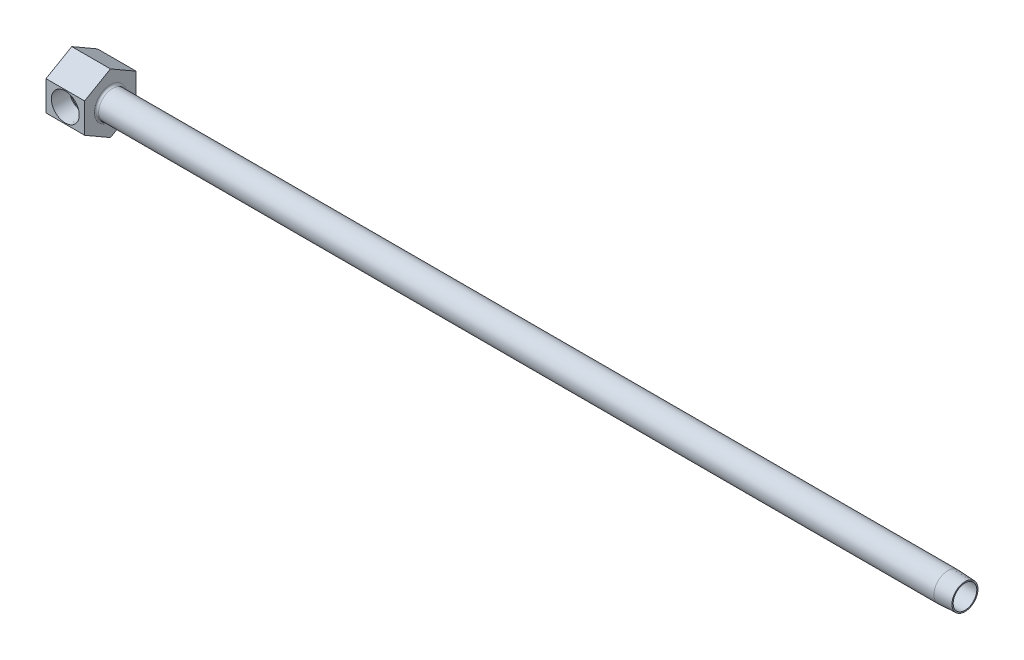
ISO-10303-21;
HEADER;
FILE_DESCRIPTION(('STEP AP214'),'2;1');
FILE_NAME('part.step','',(''),(''),'','','');
FILE_SCHEMA(('AUTOMOTIVE_DESIGN { 1 0 10303 214 1 1 1 1 }'));
ENDSEC;
DATA;
#1=APPLICATION_CONTEXT('core data for automotive mechanical design processes');
#2=APPLICATION_PROTOCOL_DEFINITION('international standard','automotive_design',2000,#1);
#3=PRODUCT_CONTEXT('',#1,'mechanical');
#4=PRODUCT('Part','Part','',(#3));
#5=PRODUCT_RELATED_PRODUCT_CATEGORY('part','',(#4));
#6=PRODUCT_DEFINITION_FORMATION('','',#4);
#7=PRODUCT_DEFINITION_CONTEXT('part definition',#1,'design');
#8=PRODUCT_DEFINITION('design','',#6,#7);
#9=PRODUCT_DEFINITION_SHAPE('','',#8);
#10=(LENGTH_UNIT() NAMED_UNIT(*) SI_UNIT(.MILLI.,.METRE.));
#11=(NAMED_UNIT(*) PLANE_ANGLE_UNIT() SI_UNIT($,.RADIAN.));
#12=(NAMED_UNIT(*) SI_UNIT($,.STERADIAN.) SOLID_ANGLE_UNIT());
#13=UNCERTAINTY_MEASURE_WITH_UNIT(LENGTH_MEASURE(1.E-05),#10,'distance_accuracy_value','');
#14=(GEOMETRIC_REPRESENTATION_CONTEXT(3) GLOBAL_UNCERTAINTY_ASSIGNED_CONTEXT((#13)) GLOBAL_UNIT_ASSIGNED_CONTEXT((#10,
#11,#12)) REPRESENTATION_CONTEXT('',''));
#15=CARTESIAN_POINT('',(0.,0.,0.));
#16=DIRECTION('',(0.,0.,1.));
#17=DIRECTION('',(1.,0.,0.));
#18=AXIS2_PLACEMENT_3D('',#15,#16,#17);
#19=CARTESIAN_POINT('',(7.14375,0.,19.05));
#20=DIRECTION('',(0.,0.,1.));
#21=DIRECTION('',(1.,0.,0.));
#22=AXIS2_PLACEMENT_3D('',#19,#20,#21);
#23=CONICAL_SURFACE('',#22,5.1435,0.0523598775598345);
#24=CARTESIAN_POINT('',(7.14375,0.,19.05));
#25=DIRECTION('',(0.,0.,-1.));
#26=DIRECTION('',(-1.,0.,0.));
#27=AXIS2_PLACEMENT_3D('',#24,#25,#26);
#28=CIRCLE('',#27,5.1435);
#29=CARTESIAN_POINT('',(2.00025,0.,19.05));
#30=VERTEX_POINT('',#29);
#31=EDGE_CURVE('E512',#30,#30,#28,.T.);
#32=ORIENTED_EDGE('',*,*,#31,.F.);
#33=EDGE_LOOP('',(#32));
#34=FACE_BOUND('',#33,.T.);
#35=CARTESIAN_POINT('',(7.14375,0.,12.7000000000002));
#36=DIRECTION('',(0.,0.,-1.));
#37=DIRECTION('',(-1.,0.,0.));
#38=AXIS2_PLACEMENT_3D('',#35,#36,#37);
#39=CIRCLE('',#38,4.81071060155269);
#40=CARTESIAN_POINT('',(10.9073758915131,-2.99634054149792,12.7000000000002));
#41=VERTEX_POINT('',#40);
#42=CARTESIAN_POINT('',(10.9073758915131,2.99634054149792,12.7000000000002));
#43=VERTEX_POINT('',#42);
#44=EDGE_CURVE('E528',#41,#43,#39,.T.);
#45=ORIENTED_EDGE('',*,*,#44,.T.);
#46=CARTESIAN_POINT('',(10.9071937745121,2.99655245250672,12.6998000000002));
#47=CARTESIAN_POINT('',(10.971635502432,2.92155827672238,12.7705639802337));
#48=CARTESIAN_POINT('',(11.0345784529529,2.84341410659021,12.8393139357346));
#49=CARTESIAN_POINT('',(11.1569073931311,2.68056902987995,12.9723675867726));
#50=CARTESIAN_POINT('',(11.2162880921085,2.59585877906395,13.0366646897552));
#51=CARTESIAN_POINT('',(11.3887731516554,2.33059710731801,13.2228141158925));
#52=CARTESIAN_POINT('',(11.4952955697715,2.13996459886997,13.3369144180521));
#53=CARTESIAN_POINT('',(11.6670238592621,1.76978922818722,13.520146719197));
#54=CARTESIAN_POINT('',(11.7362081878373,1.59429861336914,13.5936668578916));
#55=CARTESIAN_POINT('',(11.8243838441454,1.32069459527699,13.6871793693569));
#56=CARTESIAN_POINT('',(11.8511557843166,1.22786736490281,13.7155347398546));
#57=CARTESIAN_POINT('',(11.8990876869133,1.0391950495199,13.7662595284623));
#58=CARTESIAN_POINT('',(11.9202500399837,0.943351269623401,13.7886314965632));
#59=CARTESIAN_POINT('',(11.9566990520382,0.748466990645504,13.8271421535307));
#60=CARTESIAN_POINT('',(11.971935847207,0.649406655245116,13.8432279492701));
#61=CARTESIAN_POINT('',(11.9959472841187,0.449682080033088,13.8685692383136));
#62=CARTESIAN_POINT('',(12.0047249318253,0.349018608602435,13.8778279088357));
#63=CARTESIAN_POINT('',(12.0156291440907,0.146869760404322,13.8893288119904));
#64=CARTESIAN_POINT('',(12.0177517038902,0.0453839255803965,13.8915668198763));
#65=CARTESIAN_POINT('',(12.0152840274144,-0.157407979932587,13.8889645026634));
#66=CARTESIAN_POINT('',(12.0106943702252,-0.258714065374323,13.8841247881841));
#67=CARTESIAN_POINT('',(11.9957865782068,-0.449057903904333,13.8683984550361));
#68=CARTESIAN_POINT('',(11.9861593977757,-0.538211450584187,13.8582411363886));
#69=CARTESIAN_POINT('',(11.961864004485,-0.715062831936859,13.8325939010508));
#70=CARTESIAN_POINT('',(11.9471941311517,-0.802760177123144,13.8171022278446));
#71=CARTESIAN_POINT('',(11.8959888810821,-1.06271154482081,13.762990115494));
#72=CARTESIAN_POINT('',(11.8522396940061,-1.23204639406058,13.7167134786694));
#73=CARTESIAN_POINT('',(11.7458224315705,-1.56656708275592,13.6038703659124));
#74=CARTESIAN_POINT('',(11.6823922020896,-1.73122409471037,13.5364852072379));
#75=CARTESIAN_POINT('',(11.5406571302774,-2.04618319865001,13.3853583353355));
#76=CARTESIAN_POINT('',(11.4623317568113,-2.19646504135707,13.3015940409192));
#77=CARTESIAN_POINT('',(11.3067680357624,-2.45998630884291,13.1343941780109));
#78=CARTESIAN_POINT('',(11.2311482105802,-2.57539375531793,13.0528153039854));
#79=CARTESIAN_POINT('',(11.0735639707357,-2.79452635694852,12.8818550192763));
#80=CARTESIAN_POINT('',(10.9916301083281,-2.89830245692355,12.792510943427));
#81=CARTESIAN_POINT('',(10.9071937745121,-2.99655245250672,12.6998000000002));
#82=B_SPLINE_CURVE_WITH_KNOTS('',3,(#46,#47,#48,#49,#50,#51,#52,#53,#54,#55,#56,#57,#58,#59,#60,
#61,#62,#63,#64,#65,#66,#67,#68,#69,#70,#71,#72,#73,#74,#75,#76,#77,#78,#79,#80,#81),
.UNSPECIFIED.,.F.,.F.,(4,2,2,2,2,2,2,2,2,2,2,2,2,2,2,2,2,4),(0.,0.364634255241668,
0.72979730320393,1.46525067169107,2.06997219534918,2.37170467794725,2.67330836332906,
2.97739780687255,3.28134564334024,3.58547634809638,3.88958081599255,4.15999530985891,
4.43049893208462,4.97084503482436,5.53548493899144,6.10090884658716,6.58103480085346,
7.05896806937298),.UNSPECIFIED.);
#83=EDGE_CURVE('E123',#43,#41,#82,.T.);
#84=ORIENTED_EDGE('',*,*,#83,.T.);
#85=EDGE_LOOP('',(#45,#84));
#86=FACE_BOUND('',#85,.T.);
#87=ADVANCED_FACE('F15',(#34,#86),#23,.F.);
#88=CARTESIAN_POINT('',(11.9544606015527,0.,12.7000000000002));
#89=DIRECTION('',(0.,0.,1.));
#90=DIRECTION('',(1.,0.,0.));
#91=AXIS2_PLACEMENT_3D('',#88,#89,#90);
#92=PLANE('',#91);
#93=ORIENTED_EDGE('',*,*,#44,.F.);
#94=DIRECTION('',(1.,0.,0.));
#95=VECTOR('',#94,1.);
#96=CARTESIAN_POINT('',(66.1375087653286,-2.99634054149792,12.7000000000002));
#97=LINE('',#96,#95);
#98=CARTESIAN_POINT('',(10.3187500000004,-2.99634054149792,12.7000000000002));
#99=VERTEX_POINT('',#98);
#100=EDGE_CURVE('E120',#41,#99,#97,.F.);
#101=ORIENTED_EDGE('',*,*,#100,.T.);
#102=CARTESIAN_POINT('',(7.14375,0.,12.7000000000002));
#103=DIRECTION('',(0.,0.,-1.));
#104=DIRECTION('',(-1.,0.,0.));
#105=AXIS2_PLACEMENT_3D('',#102,#103,#104);
#106=CIRCLE('',#105,4.36562500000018);
#107=CARTESIAN_POINT('',(10.3187500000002,2.99634054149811,12.7000000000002));
#108=VERTEX_POINT('',#107);
#109=EDGE_CURVE('E119',#99,#108,#106,.T.);
#110=ORIENTED_EDGE('',*,*,#109,.T.);
#111=DIRECTION('',(1.,0.,0.));
#112=VECTOR('',#111,1.);
#113=CARTESIAN_POINT('',(66.1375087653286,2.99634054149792,12.7000000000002));
#114=LINE('',#113,#112);
#115=EDGE_CURVE('E126',#108,#43,#114,.T.);
#116=ORIENTED_EDGE('',*,*,#115,.T.);
#117=EDGE_LOOP('',(#93,#101,#110,#116));
#118=FACE_BOUND('',#117,.T.);
#119=ADVANCED_FACE('F156',(#118),#92,.T.);
#120=CARTESIAN_POINT('',(7.14375,0.,35.9059426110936));
#121=DIRECTION('',(0.,0.,-1.));
#122=DIRECTION('',(-1.,0.,0.));
#123=AXIS2_PLACEMENT_3D('',#120,#121,#122);
#124=CYLINDRICAL_SURFACE('',#123,4.36562500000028);
#125=ORIENTED_EDGE('',*,*,#109,.F.);
#126=CARTESIAN_POINT('',(7.14375,0.,9.525));
#127=DIRECTION('',(0.707106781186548,0.,-0.707106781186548));
#128=DIRECTION('',(-0.707106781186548,0.,-0.707106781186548));
#129=AXIS2_PLACEMENT_3D('',#126,#127,#128);
#130=ELLIPSE('',#129,6.17392608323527,4.36562500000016);
#131=CARTESIAN_POINT('',(7.14375,-4.3656250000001,9.525));
#132=VERTEX_POINT('',#131);
#133=EDGE_CURVE('E105',#99,#132,#130,.T.);
#134=ORIENTED_EDGE('',*,*,#133,.T.);
#135=CARTESIAN_POINT('',(7.14375,0.,9.525));
#136=DIRECTION('',(-0.707106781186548,0.,-0.707106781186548));
#137=DIRECTION('',(0.707106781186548,0.,-0.707106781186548));
#138=AXIS2_PLACEMENT_3D('',#135,#136,#137);
#139=ELLIPSE('',#138,6.17392608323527,4.36562500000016);
#140=CARTESIAN_POINT('',(8.98888023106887,-3.95653586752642,7.67986976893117));
#141=VERTEX_POINT('',#140);
#142=EDGE_CURVE('E100',#132,#141,#139,.F.);
#143=ORIENTED_EDGE('',*,*,#142,.T.);
#144=CARTESIAN_POINT('',(7.14375,0.,7.67986976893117));
#145=DIRECTION('',(0.,0.,-1.));
#146=DIRECTION('',(-1.,0.,0.));
#147=AXIS2_PLACEMENT_3D('',#144,#145,#146);
#148=CIRCLE('',#147,4.36562500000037);
#149=CARTESIAN_POINT('',(8.98888023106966,3.95653586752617,7.67986976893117));
#150=VERTEX_POINT('',#149);
#151=EDGE_CURVE('E113',#141,#150,#148,.T.);
#152=ORIENTED_EDGE('',*,*,#151,.T.);
#153=CARTESIAN_POINT('',(7.14375,4.3656250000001,9.525));
#154=VERTEX_POINT('',#153);
#155=EDGE_CURVE('E30',#150,#154,#139,.F.);
#156=ORIENTED_EDGE('',*,*,#155,.T.);
#157=EDGE_CURVE('E122',#154,#108,#130,.T.);
#158=ORIENTED_EDGE('',*,*,#157,.T.);
#159=EDGE_LOOP('',(#125,#134,#143,#152,#156,#158));
#160=FACE_BOUND('',#159,.T.);
#161=ADVANCED_FACE('F116',(#160),#124,.F.);
#162=CARTESIAN_POINT('',(7.14375,0.,7.67986976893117));
#163=DIRECTION('',(0.,0.,1.));
#164=DIRECTION('',(1.,0.,0.));
#165=AXIS2_PLACEMENT_3D('',#162,#163,#164);
#166=CONICAL_SURFACE('',#165,4.36562500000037,1.0471975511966);
#167=ORIENTED_EDGE('',*,*,#151,.F.);
#168=CARTESIAN_POINT('',(8.9894997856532,-3.95662913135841,7.68006976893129));
#169=CARTESIAN_POINT('',(8.91497560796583,-3.94541760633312,7.6560189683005));
#170=CARTESIAN_POINT('',(8.84020256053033,-3.93428272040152,7.6327193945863));
#171=CARTESIAN_POINT('',(8.69001846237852,-3.91242782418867,7.58793860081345));
#172=CARTESIAN_POINT('',(8.61460714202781,-3.90170800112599,7.56645819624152));
#173=CARTESIAN_POINT('',(8.38848524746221,-3.87074056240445,7.50556917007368));
#174=CARTESIAN_POINT('',(8.2367287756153,-3.8515020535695,7.46932807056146));
#175=CARTESIAN_POINT('',(8.00667896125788,-3.82676825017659,7.42384959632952));
#176=CARTESIAN_POINT('',(7.92948623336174,-3.81920348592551,7.41015805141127));
#177=CARTESIAN_POINT('',(7.77441965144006,-3.80585437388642,7.38622945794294));
#178=CARTESIAN_POINT('',(7.69654594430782,-3.80006965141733,7.37599168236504));
#179=CARTESIAN_POINT('',(7.53967894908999,-3.79060206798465,7.35933225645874));
#180=CARTESIAN_POINT('',(7.46068163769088,-3.78693482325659,7.35293894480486));
#181=CARTESIAN_POINT('',(7.30231301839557,-3.7819879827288,7.34434534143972));
#182=CARTESIAN_POINT('',(7.2229414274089,-3.78071064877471,7.34214902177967));
#183=CARTESIAN_POINT('',(7.14355,-3.78074215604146,7.34218750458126));
#184=B_SPLINE_CURVE_WITH_KNOTS('',3,(#168,#169,#170,#171,#172,#173,#174,#175,#176,#177,#178,
#179,#180,#181,#182,#183),.UNSPECIFIED.,.F.,.F.,(4,2,2,2,2,2,2,4),(0.,0.237303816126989,
0.474713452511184,0.945835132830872,1.18204117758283,1.41819746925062,1.65607385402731,
1.89417525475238),.UNSPECIFIED.);
#185=CARTESIAN_POINT('',(7.14375,-3.78074215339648,7.34218750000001));
#186=VERTEX_POINT('',#185);
#187=EDGE_CURVE('E109',#141,#186,#184,.T.);
#188=ORIENTED_EDGE('',*,*,#187,.T.);
#189=DIRECTION('',(0.,0.866025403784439,-0.5));
#190=VECTOR('',#189,1.);
#191=CARTESIAN_POINT('',(7.14375,0.,5.159375));
#192=LINE('',#191,#190);
#193=CARTESIAN_POINT('',(7.14375,0.,5.159375));
#194=VERTEX_POINT('',#193);
#195=EDGE_CURVE('E200',#186,#194,#192,.T.);
#196=ORIENTED_EDGE('',*,*,#195,.T.);
#197=DIRECTION('',(0.,0.866025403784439,0.5));
#198=VECTOR('',#197,1.);
#199=CARTESIAN_POINT('',(7.14375,0.,5.159375));
#200=LINE('',#199,#198);
#201=CARTESIAN_POINT('',(7.14375,3.78074215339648,7.34218750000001));
#202=VERTEX_POINT('',#201);
#203=EDGE_CURVE('E486',#194,#202,#200,.T.);
#204=ORIENTED_EDGE('',*,*,#203,.T.);
#205=CARTESIAN_POINT('',(7.14355,3.78074215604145,7.34218750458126));
#206=CARTESIAN_POINT('',(7.20515303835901,3.78073202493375,7.34217451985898));
#207=CARTESIAN_POINT('',(7.26674694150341,3.78149280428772,7.34348695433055));
#208=CARTESIAN_POINT('',(7.38976236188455,3.78448017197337,7.34867189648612));
#209=CARTESIAN_POINT('',(7.45118394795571,3.78670605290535,7.3525431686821));
#210=CARTESIAN_POINT('',(7.63466542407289,3.79545033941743,7.36782927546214));
#211=CARTESIAN_POINT('',(7.75632841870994,3.80403629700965,7.38291749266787));
#212=CARTESIAN_POINT('',(8.11659337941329,3.83592256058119,7.44024735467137));
#213=CARTESIAN_POINT('',(8.35266311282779,3.8653919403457,7.49460284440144));
#214=CARTESIAN_POINT('',(8.65303625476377,3.90716169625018,7.57737916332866));
#215=CARTESIAN_POINT('',(8.72054620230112,3.91683509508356,7.59689306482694));
#216=CARTESIAN_POINT('',(8.855265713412,3.93652410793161,7.63741882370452));
#217=CARTESIAN_POINT('',(8.92247399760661,3.94654056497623,7.65843453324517));
#218=CARTESIAN_POINT('',(8.9894997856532,3.9566291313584,7.68006976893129));
#219=B_SPLINE_CURVE_WITH_KNOTS('',3,(#205,#206,#207,#208,#209,#210,#211,#212,#213,#214,#215,
#216,#217,#218),.UNSPECIFIED.,.F.,.F.,(4,2,2,2,2,2,4),(0.,0.184774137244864,0.369459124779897,
0.73767480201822,1.46761028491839,1.68043381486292,1.89382432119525),.UNSPECIFIED.);
#220=EDGE_CURVE('E187',#202,#150,#219,.T.);
#221=ORIENTED_EDGE('',*,*,#220,.T.);
#222=EDGE_LOOP('',(#167,#188,#196,#204,#221));
#223=FACE_BOUND('',#222,.T.);
#224=ADVANCED_FACE('F201',(#223),#166,.F.);
#225=CARTESIAN_POINT('',(14.2875,5.4992613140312,19.05));
#226=DIRECTION('',(0.,0.,-1.));
#227=DIRECTION('',(-1.,0.,0.));
#228=AXIS2_PLACEMENT_3D('',#225,#226,#227);
#229=PLANE('',#228);
#230=DIRECTION('',(0.,-1.,0.));
#231=VECTOR('',#230,1.);
#232=CARTESIAN_POINT('',(0.,5.4992613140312,19.05));
#233=LINE('',#232,#231);
#234=CARTESIAN_POINT('',(0.,5.4992613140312,19.05));
#235=VERTEX_POINT('',#234);
#236=CARTESIAN_POINT('',(0.,-5.49926131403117,19.05));
#237=VERTEX_POINT('',#236);
#238=EDGE_CURVE('E515',#235,#237,#233,.T.);
#239=ORIENTED_EDGE('',*,*,#238,.T.);
#240=DIRECTION('',(-1.,0.,0.));
#241=VECTOR('',#240,1.);
#242=CARTESIAN_POINT('',(14.2875,-5.49926131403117,19.05));
#243=LINE('',#242,#241);
#244=CARTESIAN_POINT('',(14.2875,-5.49926131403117,19.05));
#245=VERTEX_POINT('',#244);
#246=EDGE_CURVE('E496',#245,#237,#243,.T.);
#247=ORIENTED_EDGE('',*,*,#246,.F.);
#248=DIRECTION('',(0.,-1.,0.));
#249=VECTOR('',#248,1.);
#250=CARTESIAN_POINT('',(14.2875,5.4992613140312,19.05));
#251=LINE('',#250,#249);
#252=CARTESIAN_POINT('',(14.2875,5.4992613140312,19.05));
#253=VERTEX_POINT('',#252);
#254=EDGE_CURVE('E502',#253,#245,#251,.T.);
#255=ORIENTED_EDGE('',*,*,#254,.F.);
#256=DIRECTION('',(-1.,0.,0.));
#257=VECTOR('',#256,1.);
#258=CARTESIAN_POINT('',(14.2875,5.4992613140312,19.05));
#259=LINE('',#258,#257);
#260=EDGE_CURVE('E493',#253,#235,#259,.T.);
#261=ORIENTED_EDGE('',*,*,#260,.T.);
#262=EDGE_LOOP('',(#239,#247,#255,#261));
#263=FACE_BOUND('',#262,.T.);
#264=ORIENTED_EDGE('',*,*,#31,.T.);
#265=EDGE_LOOP('',(#264));
#266=FACE_BOUND('',#265,.T.);
#267=ADVANCED_FACE('F204',(#263,#266),#229,.F.);
#268=CARTESIAN_POINT('',(14.2875,-5.49926131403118,0.));
#269=DIRECTION('',(1.,0.,0.));
#270=DIRECTION('',(0.,1.,0.));
#271=AXIS2_PLACEMENT_3D('',#268,#269,#270);
#272=PLANE('',#271);
#273=CARTESIAN_POINT('',(14.2875,0.,9.525));
#274=DIRECTION('',(1.,0.,0.));
#275=DIRECTION('',(0.,1.,0.));
#276=AXIS2_PLACEMENT_3D('',#273,#274,#275);
#277=CIRCLE('',#276,5.9309);
#278=CARTESIAN_POINT('',(14.2875,5.9309,9.525));
#279=VERTEX_POINT('',#278);
#280=EDGE_CURVE('E199',#279,#279,#277,.F.);
#281=ORIENTED_EDGE('',*,*,#280,.T.);
#282=EDGE_LOOP('',(#281));
#283=FACE_BOUND('',#282,.T.);
#284=DIRECTION('',(0.,0.5,-0.866025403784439));
#285=VECTOR('',#284,1.);
#286=CARTESIAN_POINT('',(14.2875,-10.9985226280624,9.525));
#287=LINE('',#286,#285);
#288=CARTESIAN_POINT('',(14.2875,-10.9985226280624,9.525));
#289=VERTEX_POINT('',#288);
#290=CARTESIAN_POINT('',(14.2875,-5.49926131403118,0.));
#291=VERTEX_POINT('',#290);
#292=EDGE_CURVE('E473',#289,#291,#287,.T.);
#293=ORIENTED_EDGE('',*,*,#292,.T.);
#294=DIRECTION('',(0.,1.,0.));
#295=VECTOR('',#294,1.);
#296=CARTESIAN_POINT('',(14.2875,-5.49926131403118,0.));
#297=LINE('',#296,#295);
#298=CARTESIAN_POINT('',(14.2875,5.49926131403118,0.));
#299=VERTEX_POINT('',#298);
#300=EDGE_CURVE('E475',#291,#299,#297,.T.);
#301=ORIENTED_EDGE('',*,*,#300,.T.);
#302=DIRECTION('',(0.,0.5,0.866025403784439));
#303=VECTOR('',#302,1.);
#304=CARTESIAN_POINT('',(14.2875,5.49926131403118,0.));
#305=LINE('',#304,#303);
#306=CARTESIAN_POINT('',(14.2875,10.9985226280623,9.525));
#307=VERTEX_POINT('',#306);
#308=EDGE_CURVE('E506',#299,#307,#305,.T.);
#309=ORIENTED_EDGE('',*,*,#308,.T.);
#310=DIRECTION('',(0.,-0.5,0.86602540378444));
#311=VECTOR('',#310,1.);
#312=CARTESIAN_POINT('',(14.2875,10.9985226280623,9.525));
#313=LINE('',#312,#311);
#314=EDGE_CURVE('E504',#307,#253,#313,.T.);
#315=ORIENTED_EDGE('',*,*,#314,.T.);
#316=ORIENTED_EDGE('',*,*,#254,.T.);
#317=DIRECTION('',(0.,-0.5,-0.866025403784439));
#318=VECTOR('',#317,1.);
#319=CARTESIAN_POINT('',(14.2875,-5.49926131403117,19.05));
#320=LINE('',#319,#318);
#321=EDGE_CURVE('E38',#245,#289,#320,.T.);
#322=ORIENTED_EDGE('',*,*,#321,.T.);
#323=EDGE_LOOP('',(#293,#301,#309,#315,#316,#322));
#324=FACE_BOUND('',#323,.T.);
#325=ADVANCED_FACE('F230',(#283,#324),#272,.T.);
#326=CARTESIAN_POINT('',(14.2875,-10.9985226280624,9.525));
#327=DIRECTION('',(0.,0.866025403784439,0.5));
#328=DIRECTION('',(0.,-0.5,0.866025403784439));
#329=AXIS2_PLACEMENT_3D('',#326,#327,#328);
#330=PLANE('',#329);
#331=DIRECTION('',(0.,0.5,-0.866025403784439));
#332=VECTOR('',#331,1.);
#333=CARTESIAN_POINT('',(0.,-10.9985226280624,9.525));
#334=LINE('',#333,#332);
#335=CARTESIAN_POINT('',(0.,-10.9985226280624,9.525));
#336=VERTEX_POINT('',#335);
#337=CARTESIAN_POINT('',(0.,-5.49926131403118,0.));
#338=VERTEX_POINT('',#337);
#339=EDGE_CURVE('E484',#336,#338,#334,.T.);
#340=ORIENTED_EDGE('',*,*,#339,.T.);
#341=DIRECTION('',(-1.,0.,0.));
#342=VECTOR('',#341,1.);
#343=CARTESIAN_POINT('',(14.2875,-5.49926131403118,0.));
#344=LINE('',#343,#342);
#345=EDGE_CURVE('E482',#291,#338,#344,.T.);
#346=ORIENTED_EDGE('',*,*,#345,.F.);
#347=ORIENTED_EDGE('',*,*,#292,.F.);
#348=DIRECTION('',(-1.,0.,0.));
#349=VECTOR('',#348,1.);
#350=CARTESIAN_POINT('',(14.2875,-10.9985226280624,9.525));
#351=LINE('',#350,#349);
#352=EDGE_CURVE('E499',#289,#336,#351,.T.);
#353=ORIENTED_EDGE('',*,*,#352,.T.);
#354=EDGE_LOOP('',(#340,#346,#347,#353));
#355=FACE_BOUND('',#354,.T.);
#356=ADVANCED_FACE('F239',(#355),#330,.F.);
#357=CARTESIAN_POINT('',(14.2875,-5.49926131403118,0.));
#358=DIRECTION('',(0.,0.,1.));
#359=DIRECTION('',(0.,-1.,0.));
#360=AXIS2_PLACEMENT_3D('',#357,#358,#359);
#361=PLANE('',#360);
#362=DIRECTION('',(0.,1.,0.));
#363=VECTOR('',#362,1.);
#364=CARTESIAN_POINT('',(0.,-5.49926131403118,0.));
#365=LINE('',#364,#363);
#366=CARTESIAN_POINT('',(0.,5.49926131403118,0.));
#367=VERTEX_POINT('',#366);
#368=EDGE_CURVE('E511',#338,#367,#365,.T.);
#369=ORIENTED_EDGE('',*,*,#368,.T.);
#370=DIRECTION('',(-1.,0.,0.));
#371=VECTOR('',#370,1.);
#372=CARTESIAN_POINT('',(14.2875,5.49926131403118,0.));
#373=LINE('',#372,#371);
#374=EDGE_CURVE('E485',#299,#367,#373,.T.);
#375=ORIENTED_EDGE('',*,*,#374,.F.);
#376=ORIENTED_EDGE('',*,*,#300,.F.);
#377=ORIENTED_EDGE('',*,*,#345,.T.);
#378=EDGE_LOOP('',(#369,#375,#376,#377));
#379=FACE_BOUND('',#378,.T.);
#380=ADVANCED_FACE('F247',(#379),#361,.F.);
#381=CARTESIAN_POINT('',(14.2875,5.49926131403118,0.));
#382=DIRECTION('',(0.,-0.866025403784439,0.5));
#383=DIRECTION('',(0.,-0.5,-0.866025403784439));
#384=AXIS2_PLACEMENT_3D('',#381,#382,#383);
#385=PLANE('',#384);
#386=DIRECTION('',(0.,0.5,0.866025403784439));
#387=VECTOR('',#386,1.);
#388=CARTESIAN_POINT('',(0.,5.49926131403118,0.));
#389=LINE('',#388,#387);
#390=CARTESIAN_POINT('',(0.,10.9985226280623,9.525));
#391=VERTEX_POINT('',#390);
#392=EDGE_CURVE('E521',#367,#391,#389,.T.);
#393=ORIENTED_EDGE('',*,*,#392,.T.);
#394=DIRECTION('',(-1.,0.,0.));
#395=VECTOR('',#394,1.);
#396=CARTESIAN_POINT('',(14.2875,10.9985226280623,9.525));
#397=LINE('',#396,#395);
#398=EDGE_CURVE('E488',#307,#391,#397,.T.);
#399=ORIENTED_EDGE('',*,*,#398,.F.);
#400=ORIENTED_EDGE('',*,*,#308,.F.);
#401=ORIENTED_EDGE('',*,*,#374,.T.);
#402=EDGE_LOOP('',(#393,#399,#400,#401));
#403=FACE_BOUND('',#402,.T.);
#404=ADVANCED_FACE('F255',(#403),#385,.F.);
#405=CARTESIAN_POINT('',(14.2875,10.9985226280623,9.525));
#406=DIRECTION('',(0.,-0.86602540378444,-0.5));
#407=DIRECTION('',(0.,0.5,-0.86602540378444));
#408=AXIS2_PLACEMENT_3D('',#405,#406,#407);
#409=PLANE('',#408);
#410=DIRECTION('',(0.,-0.5,0.86602540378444));
#411=VECTOR('',#410,1.);
#412=CARTESIAN_POINT('',(0.,10.9985226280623,9.525));
#413=LINE('',#412,#411);
#414=EDGE_CURVE('E518',#391,#235,#413,.T.);
#415=ORIENTED_EDGE('',*,*,#414,.T.);
#416=ORIENTED_EDGE('',*,*,#260,.F.);
#417=ORIENTED_EDGE('',*,*,#314,.F.);
#418=ORIENTED_EDGE('',*,*,#398,.T.);
#419=EDGE_LOOP('',(#415,#416,#417,#418));
#420=FACE_BOUND('',#419,.T.);
#421=ADVANCED_FACE('F264',(#420),#409,.F.);
#422=CARTESIAN_POINT('',(14.2875,-5.49926131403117,19.05));
#423=DIRECTION('',(0.,0.866025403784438,-0.5));
#424=DIRECTION('',(0.,0.5,0.866025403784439));
#425=AXIS2_PLACEMENT_3D('',#422,#423,#424);
#426=PLANE('',#425);
#427=DIRECTION('',(0.,-0.5,-0.866025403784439));
#428=VECTOR('',#427,1.);
#429=CARTESIAN_POINT('',(0.,-5.49926131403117,19.05));
#430=LINE('',#429,#428);
#431=EDGE_CURVE('E478',#237,#336,#430,.T.);
#432=ORIENTED_EDGE('',*,*,#431,.T.);
#433=ORIENTED_EDGE('',*,*,#352,.F.);
#434=ORIENTED_EDGE('',*,*,#321,.F.);
#435=ORIENTED_EDGE('',*,*,#246,.T.);
#436=EDGE_LOOP('',(#432,#433,#434,#435));
#437=FACE_BOUND('',#436,.T.);
#438=ADVANCED_FACE('F273',(#437),#426,.F.);
#439=CARTESIAN_POINT('',(0.,-5.49926131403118,0.));
#440=DIRECTION('',(1.,0.,0.));
#441=DIRECTION('',(0.,1.,0.));
#442=AXIS2_PLACEMENT_3D('',#439,#440,#441);
#443=PLANE('',#442);
#444=ORIENTED_EDGE('',*,*,#339,.F.);
#445=ORIENTED_EDGE('',*,*,#431,.F.);
#446=ORIENTED_EDGE('',*,*,#238,.F.);
#447=ORIENTED_EDGE('',*,*,#414,.F.);
#448=ORIENTED_EDGE('',*,*,#392,.F.);
#449=ORIENTED_EDGE('',*,*,#368,.F.);
#450=EDGE_LOOP('',(#444,#445,#446,#447,#448,#449));
#451=FACE_BOUND('',#450,.T.);
#452=ADVANCED_FACE('F170',(#451),#443,.F.);
#453=CARTESIAN_POINT('',(68.0114010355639,0.,9.525));
#454=DIRECTION('',(-1.,0.,0.));
#455=DIRECTION('',(0.,0.,1.));
#456=AXIS2_PLACEMENT_3D('',#453,#454,#455);
#457=CYLINDRICAL_SURFACE('',#456,5.1435);
#458=CARTESIAN_POINT('',(323.85,0.,9.525));
#459=DIRECTION('',(-1.,0.,0.));
#460=DIRECTION('',(0.,0.,1.));
#461=AXIS2_PLACEMENT_3D('',#458,#459,#460);
#462=CIRCLE('',#461,5.1435);
#463=CARTESIAN_POINT('',(323.85,0.,14.6685));
#464=VERTEX_POINT('',#463);
#465=EDGE_CURVE('E10',#464,#464,#462,.F.);
#466=ORIENTED_EDGE('',*,*,#465,.F.);
#467=EDGE_LOOP('',(#466));
#468=FACE_BOUND('',#467,.T.);
#469=CARTESIAN_POINT('',(15.0749,0.,9.525));
#470=DIRECTION('',(1.,0.,0.));
#471=DIRECTION('',(0.,1.,0.));
#472=AXIS2_PLACEMENT_3D('',#469,#470,#471);
#473=CIRCLE('',#472,5.1435);
#474=CARTESIAN_POINT('',(15.0749,5.1435,9.525));
#475=VERTEX_POINT('',#474);
#476=EDGE_CURVE('E23',#475,#475,#473,.T.);
#477=ORIENTED_EDGE('',*,*,#476,.T.);
#478=EDGE_LOOP('',(#477));
#479=FACE_BOUND('',#478,.T.);
#480=ADVANCED_FACE('F17',(#468,#479),#457,.T.);
#481=CARTESIAN_POINT('',(7.14375,0.,9.525));
#482=DIRECTION('',(1.,0.,0.));
#483=DIRECTION('',(0.,0.,-1.));
#484=AXIS2_PLACEMENT_3D('',#481,#482,#483);
#485=PLANE('',#484);
#486=CARTESIAN_POINT('',(7.14375,0.,9.525));
#487=DIRECTION('',(1.,0.,0.));
#488=DIRECTION('',(0.,0.,-1.));
#489=AXIS2_PLACEMENT_3D('',#486,#487,#488);
#490=CIRCLE('',#489,4.365625);
#491=EDGE_CURVE('E130',#194,#202,#490,.T.);
#492=ORIENTED_EDGE('',*,*,#491,.T.);
#493=ORIENTED_EDGE('',*,*,#203,.F.);
#494=EDGE_LOOP('',(#492,#493));
#495=FACE_BOUND('',#494,.T.);
#496=ADVANCED_FACE('F297',(#495),#485,.T.);
#497=EDGE_CURVE('E128',#186,#194,#490,.T.);
#498=ORIENTED_EDGE('',*,*,#497,.T.);
#499=ORIENTED_EDGE('',*,*,#195,.F.);
#500=EDGE_LOOP('',(#498,#499));
#501=FACE_BOUND('',#500,.T.);
#502=ADVANCED_FACE('F182',(#501),#485,.T.);
#503=CARTESIAN_POINT('',(66.1375087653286,0.,9.525));
#504=DIRECTION('',(1.,0.,0.));
#505=DIRECTION('',(0.,0.,-1.));
#506=AXIS2_PLACEMENT_3D('',#503,#504,#505);
#507=CYLINDRICAL_SURFACE('',#506,4.365625);
#508=ORIENTED_EDGE('',*,*,#142,.F.);
#509=ORIENTED_EDGE('',*,*,#133,.F.);
#510=ORIENTED_EDGE('',*,*,#100,.F.);
#511=ORIENTED_EDGE('',*,*,#83,.F.);
#512=ORIENTED_EDGE('',*,*,#115,.F.);
#513=ORIENTED_EDGE('',*,*,#157,.F.);
#514=ORIENTED_EDGE('',*,*,#155,.F.);
#515=ORIENTED_EDGE('',*,*,#220,.F.);
#516=ORIENTED_EDGE('',*,*,#491,.F.);
#517=ORIENTED_EDGE('',*,*,#497,.F.);
#518=ORIENTED_EDGE('',*,*,#187,.F.);
#519=EDGE_LOOP('',(#508,#509,#510,#511,#512,#513,#514,#515,#516,#517,#518));
#520=FACE_BOUND('',#519,.T.);
#521=CARTESIAN_POINT('',(330.2,0.,9.525));
#522=DIRECTION('',(1.,0.,0.));
#523=DIRECTION('',(0.,0.,-1.));
#524=AXIS2_PLACEMENT_3D('',#521,#522,#523);
#525=CIRCLE('',#524,4.365625);
#526=CARTESIAN_POINT('',(330.2,0.,5.159375));
#527=VERTEX_POINT('',#526);
#528=EDGE_CURVE('E134',#527,#527,#525,.T.);
#529=ORIENTED_EDGE('',*,*,#528,.T.);
#530=EDGE_LOOP('',(#529));
#531=FACE_BOUND('',#530,.T.);
#532=ADVANCED_FACE('F102',(#520,#531),#507,.F.);
#533=CARTESIAN_POINT('',(15.0749,0.,9.525));
#534=DIRECTION('',(1.,0.,0.));
#535=DIRECTION('',(0.,1.,0.));
#536=AXIS2_PLACEMENT_3D('',#533,#534,#535);
#537=TOROIDAL_SURFACE('',#536,5.9309,0.7874);
#538=ORIENTED_EDGE('',*,*,#476,.F.);
#539=EDGE_LOOP('',(#538));
#540=FACE_BOUND('',#539,.T.);
#541=ORIENTED_EDGE('',*,*,#280,.F.);
#542=EDGE_LOOP('',(#541));
#543=FACE_BOUND('',#542,.T.);
#544=ADVANCED_FACE('F153',(#540,#543),#537,.F.);
#545=CARTESIAN_POINT('',(330.2,0.,5.159375));
#546=DIRECTION('',(1.,0.,0.));
#547=DIRECTION('',(0.,0.,-1.));
#548=AXIS2_PLACEMENT_3D('',#545,#546,#547);
#549=PLANE('',#548);
#550=CARTESIAN_POINT('',(330.2,0.,9.525));
#551=DIRECTION('',(1.,0.,0.));
#552=DIRECTION('',(0.,0.,-1.));
#553=AXIS2_PLACEMENT_3D('',#550,#551,#552);
#554=CIRCLE('',#553,4.81071060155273);
#555=CARTESIAN_POINT('',(330.2,0.,4.71428939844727));
#556=VERTEX_POINT('',#555);
#557=EDGE_CURVE('E137',#556,#556,#554,.T.);
#558=ORIENTED_EDGE('',*,*,#557,.T.);
#559=EDGE_LOOP('',(#558));
#560=FACE_BOUND('',#559,.T.);
#561=ORIENTED_EDGE('',*,*,#528,.F.);
#562=EDGE_LOOP('',(#561));
#563=FACE_BOUND('',#562,.T.);
#564=ADVANCED_FACE('F141',(#560,#563),#549,.T.);
#565=CARTESIAN_POINT('',(330.2,0.,9.525));
#566=DIRECTION('',(-1.,0.,0.));
#567=DIRECTION('',(0.,0.,1.));
#568=AXIS2_PLACEMENT_3D('',#565,#566,#567);
#569=CONICAL_SURFACE('',#568,4.81071060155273,0.0523598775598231);
#570=ORIENTED_EDGE('',*,*,#465,.T.);
#571=EDGE_LOOP('',(#570));
#572=FACE_BOUND('',#571,.T.);
#573=ORIENTED_EDGE('',*,*,#557,.F.);
#574=EDGE_LOOP('',(#573));
#575=FACE_BOUND('',#574,.T.);
#576=ADVANCED_FACE('F144',(#572,#575),#569,.T.);
#577=CLOSED_SHELL('',(#87,#119,#161,#224,#267,#325,#356,#380,#404,#421,#438,#452,#480,#496,#502,
#532,#544,#564,#576));
#578=MANIFOLD_SOLID_BREP('B1',#577);
#579=ADVANCED_BREP_SHAPE_REPRESENTATION('',(#18,#578),#14);
#580=SHAPE_DEFINITION_REPRESENTATION(#9,#579);
ENDSEC;
END-ISO-10303-21;
